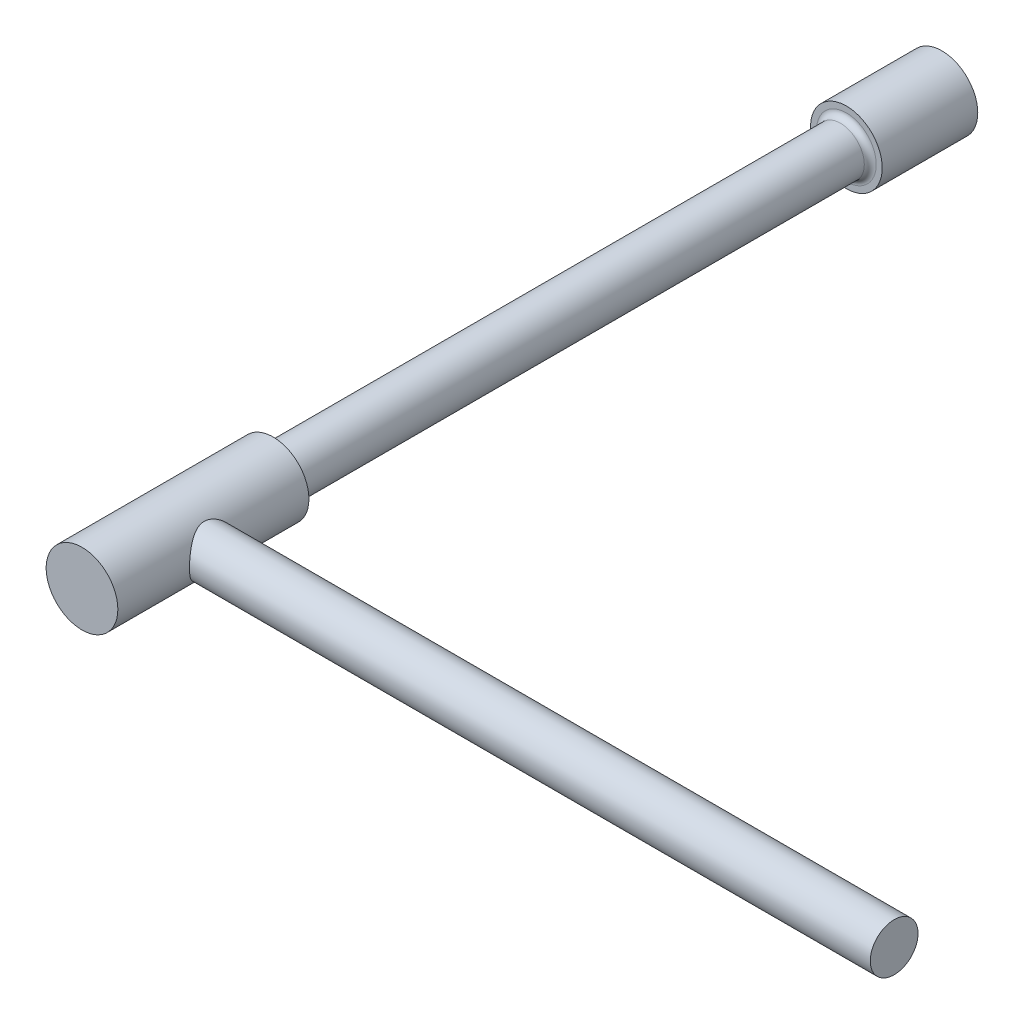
ISO-10303-21;
HEADER;
FILE_DESCRIPTION(('STEP AP214'),'2;1');
FILE_NAME('part.step','',(''),(''),'','','');
FILE_SCHEMA(('AUTOMOTIVE_DESIGN { 1 0 10303 214 1 1 1 1 }'));
ENDSEC;
DATA;
#1=APPLICATION_CONTEXT('core data for automotive mechanical design processes');
#2=APPLICATION_PROTOCOL_DEFINITION('international standard','automotive_design',2000,#1);
#3=PRODUCT_CONTEXT('',#1,'mechanical');
#4=PRODUCT('Part','Part','',(#3));
#5=PRODUCT_RELATED_PRODUCT_CATEGORY('part','',(#4));
#6=PRODUCT_DEFINITION_FORMATION('','',#4);
#7=PRODUCT_DEFINITION_CONTEXT('part definition',#1,'design');
#8=PRODUCT_DEFINITION('design','',#6,#7);
#9=PRODUCT_DEFINITION_SHAPE('','',#8);
#10=(LENGTH_UNIT() NAMED_UNIT(*) SI_UNIT(.MILLI.,.METRE.));
#11=(NAMED_UNIT(*) PLANE_ANGLE_UNIT() SI_UNIT($,.RADIAN.));
#12=(NAMED_UNIT(*) SI_UNIT($,.STERADIAN.) SOLID_ANGLE_UNIT());
#13=UNCERTAINTY_MEASURE_WITH_UNIT(LENGTH_MEASURE(1.E-05),#10,'distance_accuracy_value','');
#14=(GEOMETRIC_REPRESENTATION_CONTEXT(3) GLOBAL_UNCERTAINTY_ASSIGNED_CONTEXT((#13)) GLOBAL_UNIT_ASSIGNED_CONTEXT((#10,
#11,#12)) REPRESENTATION_CONTEXT('',''));
#15=CARTESIAN_POINT('',(0.,0.,0.));
#16=DIRECTION('',(0.,0.,1.));
#17=DIRECTION('',(1.,0.,0.));
#18=AXIS2_PLACEMENT_3D('',#15,#16,#17);
#19=CARTESIAN_POINT('',(0.,0.,457.2));
#20=DIRECTION('',(0.,0.,-1.));
#21=DIRECTION('',(-1.,0.,0.));
#22=AXIS2_PLACEMENT_3D('',#19,#20,#21);
#23=CYLINDRICAL_SURFACE('',#22,19.05);
#24=CARTESIAN_POINT('',(0.,0.,457.2));
#25=DIRECTION('',(0.,0.,1.));
#26=DIRECTION('',(1.,0.,0.));
#27=AXIS2_PLACEMENT_3D('',#24,#25,#26);
#28=CIRCLE('',#27,19.05);
#29=CARTESIAN_POINT('',(19.05,0.,457.2));
#30=VERTEX_POINT('',#29);
#31=EDGE_CURVE('E68',#30,#30,#28,.T.);
#32=ORIENTED_EDGE('',*,*,#31,.F.);
#33=EDGE_LOOP('',(#32));
#34=FACE_BOUND('',#33,.T.);
#35=CARTESIAN_POINT('',(0.,0.,355.6));
#36=DIRECTION('',(0.,0.,1.));
#37=DIRECTION('',(1.,0.,0.));
#38=AXIS2_PLACEMENT_3D('',#35,#36,#37);
#39=CIRCLE('',#38,19.05);
#40=CARTESIAN_POINT('',(19.05,0.,355.6));
#41=VERTEX_POINT('',#40);
#42=EDGE_CURVE('E71',#41,#41,#39,.T.);
#43=ORIENTED_EDGE('',*,*,#42,.T.);
#44=EDGE_LOOP('',(#43));
#45=FACE_BOUND('',#44,.T.);
#46=CARTESIAN_POINT('',(19.05,0.,419.1));
#47=CARTESIAN_POINT('',(19.0499999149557,-0.319044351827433,419.099999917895));
#48=CARTESIAN_POINT('',(19.041968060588,-0.638090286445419,419.087961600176));
#49=CARTESIAN_POINT('',(19.0100429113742,-1.27357416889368,419.039998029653));
#50=CARTESIAN_POINT('',(18.9861495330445,-1.59001210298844,419.004072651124));
#51=CARTESIAN_POINT('',(18.9230795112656,-2.21792085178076,418.90886518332));
#52=CARTESIAN_POINT('',(18.8838969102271,-2.52938968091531,418.849573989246));
#53=CARTESIAN_POINT('',(18.7911802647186,-3.14498780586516,418.708484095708));
#54=CARTESIAN_POINT('',(18.7376460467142,-3.44911701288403,418.626685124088));
#55=CARTESIAN_POINT('',(18.6177206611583,-4.04665380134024,418.442089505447));
#56=CARTESIAN_POINT('',(18.551392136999,-4.34010566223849,418.339395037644));
#57=CARTESIAN_POINT('',(18.4071052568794,-4.91621490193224,418.113945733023));
#58=CARTESIAN_POINT('',(18.3291469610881,-5.19887233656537,417.99119099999));
#59=CARTESIAN_POINT('',(18.1631367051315,-5.75207432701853,417.726853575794));
#60=CARTESIAN_POINT('',(18.0750863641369,-6.02262081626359,417.585273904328));
#61=CARTESIAN_POINT('',(17.890458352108,-6.55074759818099,417.284397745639));
#62=CARTESIAN_POINT('',(17.7938775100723,-6.80832301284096,417.12509466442));
#63=CARTESIAN_POINT('',(17.5854082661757,-7.33086574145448,416.775710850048));
#64=CARTESIAN_POINT('',(17.4729161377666,-7.59461321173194,416.584166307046));
#65=CARTESIAN_POINT('',(17.2420675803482,-8.10506530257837,416.182808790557));
#66=CARTESIAN_POINT('',(17.1237109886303,-8.35176944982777,415.972995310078));
#67=CARTESIAN_POINT('',(16.8831992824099,-8.82787123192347,415.535824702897));
#68=CARTESIAN_POINT('',(16.7610388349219,-9.057242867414,415.308442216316));
#69=CARTESIAN_POINT('',(16.5154631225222,-9.49765992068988,414.837323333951));
#70=CARTESIAN_POINT('',(16.3920481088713,-9.70870893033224,414.59359016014));
#71=CARTESIAN_POINT('',(16.1269912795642,-10.1438339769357,414.050624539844));
#72=CARTESIAN_POINT('',(15.9855513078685,-10.3646977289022,413.74870853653));
#73=CARTESIAN_POINT('',(15.7084356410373,-10.7800697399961,413.124628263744));
#74=CARTESIAN_POINT('',(15.5727612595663,-10.9745720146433,412.80245942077));
#75=CARTESIAN_POINT('',(15.3120771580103,-11.3354426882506,412.139337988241));
#76=CARTESIAN_POINT('',(15.1870504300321,-11.5018563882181,411.798416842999));
#77=CARTESIAN_POINT('',(14.9525421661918,-11.8051159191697,411.098366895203));
#78=CARTESIAN_POINT('',(14.8430611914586,-11.9419606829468,410.739237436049));
#79=CARTESIAN_POINT('',(14.6737887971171,-12.148859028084,410.110908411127));
#80=CARTESIAN_POINT('',(14.6087779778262,-12.2267886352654,409.845687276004));
#81=CARTESIAN_POINT('',(14.4914306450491,-12.3656463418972,409.308220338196));
#82=CARTESIAN_POINT('',(14.4390859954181,-12.4265853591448,409.035979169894));
#83=CARTESIAN_POINT('',(14.348894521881,-12.5306215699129,408.486077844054));
#84=CARTESIAN_POINT('',(14.3110297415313,-12.5737408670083,408.208424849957));
#85=CARTESIAN_POINT('',(14.2511622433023,-12.6415558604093,407.64915768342));
#86=CARTESIAN_POINT('',(14.2291596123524,-12.6662514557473,407.367543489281));
#87=CARTESIAN_POINT('',(14.2018752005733,-12.6968370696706,406.801303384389));
#88=CARTESIAN_POINT('',(14.1966630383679,-12.7026487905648,406.516669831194));
#89=CARTESIAN_POINT('',(14.2033816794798,-12.695135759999,405.947860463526));
#90=CARTESIAN_POINT('',(14.2153125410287,-12.6818109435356,405.663684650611));
#91=CARTESIAN_POINT('',(14.2558189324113,-12.6362591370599,405.097853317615));
#92=CARTESIAN_POINT('',(14.2844068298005,-12.6040181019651,404.816199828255));
#93=CARTESIAN_POINT('',(14.357069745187,-12.5211847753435,404.257651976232));
#94=CARTESIAN_POINT('',(14.4011450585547,-12.470592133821,403.980757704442));
#95=CARTESIAN_POINT('',(14.5008617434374,-12.3544761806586,403.445590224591));
#96=CARTESIAN_POINT('',(14.5559009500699,-12.2897177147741,403.187036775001));
#97=CARTESIAN_POINT('',(14.6769594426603,-12.1448862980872,402.676816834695));
#98=CARTESIAN_POINT('',(14.7429822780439,-12.0648083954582,402.425152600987));
#99=CARTESIAN_POINT('',(14.8842370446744,-11.8901049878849,401.929604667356));
#100=CARTESIAN_POINT('',(14.9594690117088,-11.7954794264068,401.685720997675));
#101=CARTESIAN_POINT('',(15.1173998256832,-11.592379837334,401.206300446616));
#102=CARTESIAN_POINT('',(15.2000989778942,-11.4839052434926,400.970763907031));
#103=CARTESIAN_POINT('',(15.3887310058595,-11.2302825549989,400.461367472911));
#104=CARTESIAN_POINT('',(15.4959665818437,-11.0821640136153,400.189466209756));
#105=CARTESIAN_POINT('',(15.7161179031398,-10.7676822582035,399.658923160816));
#106=CARTESIAN_POINT('',(15.829033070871,-10.6013208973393,399.400280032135));
#107=CARTESIAN_POINT('',(16.058224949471,-10.2508438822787,398.896367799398));
#108=CARTESIAN_POINT('',(16.1745055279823,-10.0667071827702,398.651115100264));
#109=CARTESIAN_POINT('',(16.4080174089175,-9.68143701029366,398.174818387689));
#110=CARTESIAN_POINT('',(16.525248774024,-9.48030240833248,397.943775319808));
#111=CARTESIAN_POINT('',(16.7837163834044,-9.01633250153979,397.448213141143));
#112=CARTESIAN_POINT('',(16.9246742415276,-8.7495482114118,397.187227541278));
#113=CARTESIAN_POINT('',(17.2012588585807,-8.19243189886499,396.688467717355));
#114=CARTESIAN_POINT('',(17.3368846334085,-7.90209555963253,396.450697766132));
#115=CARTESIAN_POINT('',(17.5992409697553,-7.29912570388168,396.000275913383));
#116=CARTESIAN_POINT('',(17.7259780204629,-6.98650879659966,395.787605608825));
#117=CARTESIAN_POINT('',(17.9673044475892,-6.34014069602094,395.389249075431));
#118=CARTESIAN_POINT('',(18.0818971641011,-6.00639535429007,395.203555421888));
#119=CARTESIAN_POINT('',(18.2747724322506,-5.38691504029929,394.894944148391));
#120=CARTESIAN_POINT('',(18.3557696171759,-5.10459086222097,394.766855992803));
#121=CARTESIAN_POINT('',(18.5062654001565,-4.5287042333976,394.530811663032));
#122=CARTESIAN_POINT('',(18.5757661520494,-4.23514390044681,394.422851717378));
#123=CARTESIAN_POINT('',(18.7017836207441,-3.6385009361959,394.228323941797));
#124=CARTESIAN_POINT('',(18.7583086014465,-3.33542450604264,394.141742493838));
#125=CARTESIAN_POINT('',(18.8571698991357,-2.72145399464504,393.990987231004));
#126=CARTESIAN_POINT('',(18.8995059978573,-2.41055979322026,393.926813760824));
#127=CARTESIAN_POINT('',(18.9691377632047,-1.78179294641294,393.821555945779));
#128=CARTESIAN_POINT('',(18.996366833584,-1.46389572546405,393.780573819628));
#129=CARTESIAN_POINT('',(19.034820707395,-0.82494114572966,393.722761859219));
#130=CARTESIAN_POINT('',(19.0460454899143,-0.503883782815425,393.705932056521));
#131=CARTESIAN_POINT('',(19.0522045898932,0.138725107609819,393.696692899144));
#132=CARTESIAN_POINT('',(19.0471395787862,0.460276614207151,393.704282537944));
#133=CARTESIAN_POINT('',(19.0208492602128,1.1012052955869,393.743759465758));
#134=CARTESIAN_POINT('',(18.9996246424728,1.42058256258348,393.775645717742));
#135=CARTESIAN_POINT('',(18.9436003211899,2.03226782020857,393.860127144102));
#136=CARTESIAN_POINT('',(18.9098612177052,2.32489890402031,393.911106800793));
#137=CARTESIAN_POINT('',(18.8295982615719,2.90417350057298,394.032972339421));
#138=CARTESIAN_POINT('',(18.7830751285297,3.19081734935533,394.103857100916));
#139=CARTESIAN_POINT('',(18.6781723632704,3.75647970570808,394.264706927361));
#140=CARTESIAN_POINT('',(18.6197919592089,4.03549771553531,394.354673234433));
#141=CARTESIAN_POINT('',(18.4922798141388,4.58448654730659,394.552736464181));
#142=CARTESIAN_POINT('',(18.4231475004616,4.85445688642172,394.660834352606));
#143=CARTESIAN_POINT('',(18.2708860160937,5.40020940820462,394.901219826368));
#144=CARTESIAN_POINT('',(18.1871630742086,5.67535503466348,395.034575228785));
#145=CARTESIAN_POINT('',(18.0105704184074,6.21304645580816,395.319358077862));
#146=CARTESIAN_POINT('',(17.9177004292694,6.47559187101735,395.47078606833));
#147=CARTESIAN_POINT('',(17.7244005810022,6.98734375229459,395.790658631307));
#148=CARTESIAN_POINT('',(17.6239673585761,7.23654419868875,395.959110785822));
#149=CARTESIAN_POINT('',(17.4172474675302,7.72083737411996,396.311964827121));
#150=CARTESIAN_POINT('',(17.3109601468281,7.95592852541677,396.49636849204));
#151=CARTESIAN_POINT('',(17.0771108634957,8.44749054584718,396.910589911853));
#152=CARTESIAN_POINT('',(16.948842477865,8.70146366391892,397.142977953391));
#153=CARTESIAN_POINT('',(16.6895134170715,9.18906491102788,397.626797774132));
#154=CARTESIAN_POINT('',(16.5584523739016,9.42269033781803,397.878232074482));
#155=CARTESIAN_POINT('',(16.2963694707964,9.8690353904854,398.399379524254));
#156=CARTESIAN_POINT('',(16.1653476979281,10.0817407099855,398.669104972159));
#157=CARTESIAN_POINT('',(15.9065761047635,10.485264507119,399.225919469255));
#158=CARTESIAN_POINT('',(15.7788259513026,10.6760852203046,399.51300674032));
#159=CARTESIAN_POINT('',(15.540546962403,11.0197028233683,400.078903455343));
#160=CARTESIAN_POINT('',(15.4294753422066,11.1743505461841,400.356360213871));
#161=CARTESIAN_POINT('',(15.2158323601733,11.4635626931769,400.924747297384));
#162=CARTESIAN_POINT('',(15.1132611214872,11.5981268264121,401.215677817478));
#163=CARTESIAN_POINT('',(14.9199086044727,11.8458215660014,401.809799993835));
#164=CARTESIAN_POINT('',(14.8291101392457,11.9589835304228,402.11297290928));
#165=CARTESIAN_POINT('',(14.662441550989,12.162757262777,402.730795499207));
#166=CARTESIAN_POINT('',(14.58656799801,12.2533742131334,403.045442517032));
#167=CARTESIAN_POINT('',(14.4650085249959,12.3964989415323,403.626976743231));
#168=CARTESIAN_POINT('',(14.4163477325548,12.4529292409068,403.892279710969));
#169=CARTESIAN_POINT('',(14.3328687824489,12.5489216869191,404.428049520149));
#170=CARTESIAN_POINT('',(14.2980478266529,12.5884872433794,404.698515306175));
#171=CARTESIAN_POINT('',(14.2435454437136,12.6501231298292,405.242718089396));
#172=CARTESIAN_POINT('',(14.2238506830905,12.6722088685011,405.516451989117));
#173=CARTESIAN_POINT('',(14.2003241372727,12.6985673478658,406.065469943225));
#174=CARTESIAN_POINT('',(14.1964925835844,12.7028398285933,406.340754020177));
#175=CARTESIAN_POINT('',(14.2048515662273,12.6934916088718,406.890928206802));
#176=CARTESIAN_POINT('',(14.2170512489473,12.6798606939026,407.165818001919));
#177=CARTESIAN_POINT('',(14.2569974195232,12.6349285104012,407.712991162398));
#178=CARTESIAN_POINT('',(14.2847437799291,12.6036273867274,407.985274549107));
#179=CARTESIAN_POINT('',(14.3547629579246,12.523820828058,408.525701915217));
#180=CARTESIAN_POINT('',(14.3970516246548,12.4752966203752,408.793841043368));
#181=CARTESIAN_POINT('',(14.4946700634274,12.3617406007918,409.324202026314));
#182=CARTESIAN_POINT('',(14.5500027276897,12.2967051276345,409.586422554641));
#183=CARTESIAN_POINT('',(14.6882370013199,12.131474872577,410.172682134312));
#184=CARTESIAN_POINT('',(14.7745561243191,12.0265291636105,410.494582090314));
#185=CARTESIAN_POINT('',(14.9616336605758,11.7929800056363,411.125337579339));
#186=CARTESIAN_POINT('',(15.0623960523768,11.6643700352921,411.434189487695));
#187=CARTESIAN_POINT('',(15.2748294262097,11.3847676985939,412.038075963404));
#188=CARTESIAN_POINT('',(15.386512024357,11.2337514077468,412.333095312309));
#189=CARTESIAN_POINT('',(15.6173044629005,10.910624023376,412.908232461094));
#190=CARTESIAN_POINT('',(15.736413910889,10.7385140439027,413.188351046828));
#191=CARTESIAN_POINT('',(15.9811861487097,10.3708171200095,413.73808421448));
#192=CARTESIAN_POINT('',(16.106928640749,10.1748607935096,414.007415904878));
#193=CARTESIAN_POINT('',(16.3599595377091,9.76282141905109,414.5294461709));
#194=CARTESIAN_POINT('',(16.4872479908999,9.54673774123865,414.782144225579));
#195=CARTESIAN_POINT('',(16.7406639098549,9.09503982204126,415.270221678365));
#196=CARTESIAN_POINT('',(16.8667910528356,8.85942032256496,415.505596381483));
#197=CARTESIAN_POINT('',(17.1152748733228,8.36931136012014,415.95802611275));
#198=CARTESIAN_POINT('',(17.2376312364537,8.1148203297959,416.175079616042));
#199=CARTESIAN_POINT('',(17.4932547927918,7.54970254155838,416.619545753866));
#200=CARTESIAN_POINT('',(17.6255602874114,7.23626632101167,416.843958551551));
#201=CARTESIAN_POINT('',(17.8784147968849,6.58682136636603,417.265247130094));
#202=CARTESIAN_POINT('',(17.9989620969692,6.25080935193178,417.462118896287));
#203=CARTESIAN_POINT('',(18.2246695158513,5.55844604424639,417.825688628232));
#204=CARTESIAN_POINT('',(18.3298484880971,5.20212043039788,417.992423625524));
#205=CARTESIAN_POINT('',(18.5216848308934,4.47127050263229,418.293433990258));
#206=CARTESIAN_POINT('',(18.6083487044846,4.09675263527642,418.427720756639));
#207=CARTESIAN_POINT('',(18.7433618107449,3.41771005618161,418.635434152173));
#208=CARTESIAN_POINT('',(18.7959457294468,3.11611666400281,418.715753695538));
#209=CARTESIAN_POINT('',(18.8869925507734,2.50581917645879,418.854265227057));
#210=CARTESIAN_POINT('',(18.9254581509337,2.19711645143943,418.912461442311));
#211=CARTESIAN_POINT('',(18.9873565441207,1.57494955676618,419.00588878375));
#212=CARTESIAN_POINT('',(19.0107983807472,1.2614883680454,419.041133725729));
#213=CARTESIAN_POINT('',(19.0421204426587,0.63201870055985,419.088189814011));
#214=CARTESIAN_POINT('',(19.0500000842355,0.31601012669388,419.100000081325));
#215=CARTESIAN_POINT('',(19.05,0.,419.1));
#216=B_SPLINE_CURVE_WITH_KNOTS('',3,(#46,#47,#48,#49,#50,#51,#52,#53,#54,#55,#56,#57,#58,#59,
#60,#61,#62,#63,#64,#65,#66,#67,#68,#69,#70,#71,#72,#73,#74,#75,#76,#77,#78,#79,#80,#81,#82,#83,
#84,#85,#86,#87,#88,#89,#90,#91,#92,#93,#94,#95,#96,#97,#98,#99,#100,#101,#102,#103,#104,#105,
#106,#107,#108,#109,#110,#111,#112,#113,#114,#115,#116,#117,#118,#119,#120,#121,#122,#123,#124,
#125,#126,#127,#128,#129,#130,#131,#132,#133,#134,#135,#136,#137,#138,#139,#140,#141,#142,#143,
#144,#145,#146,#147,#148,#149,#150,#151,#152,#153,#154,#155,#156,#157,#158,#159,#160,#161,#162,
#163,#164,#165,#166,#167,#168,#169,#170,#171,#172,#173,#174,#175,#176,#177,#178,#179,#180,#181,
#182,#183,#184,#185,#186,#187,#188,#189,#190,#191,#192,#193,#194,#195,#196,#197,#198,#199,#200,
#201,#202,#203,#204,#205,#206,#207,#208,#209,#210,#211,#212,#213,#214,#215),.UNSPECIFIED.,.T.,
.F.,(4,2,2,2,2,2,2,2,2,2,2,2,2,2,2,2,2,2,2,2,2,2,2,2,2,2,2,2,2,2,2,2,2,2,2,2,2,2,2,2,2,2,2,2,2,
2,2,2,2,2,2,2,2,2,2,2,2,2,2,2,2,2,2,2,2,2,2,2,2,2,2,2,2,2,2,2,2,2,2,2,2,2,2,2,4),(0.,
0.956810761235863,1.91362655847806,2.87081556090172,3.82801613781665,4.78064387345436,
5.73326668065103,6.68573686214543,7.63856260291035,8.67204187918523,9.7055498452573,
10.7405785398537,11.7754038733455,12.9737687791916,14.1724052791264,15.369089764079,
16.5658174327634,17.4169624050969,18.2675591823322,19.1170976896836,19.9666408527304,
20.8197019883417,21.6727660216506,22.526464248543,23.3801787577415,24.1958922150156,
25.011869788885,25.8278505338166,26.6438646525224,27.625984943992,28.6080055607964,
29.5912034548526,30.574466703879,31.7698891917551,32.96553128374,34.1602912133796,
35.3547216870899,36.3150486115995,37.2751954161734,38.2347290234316,39.1942773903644,
40.1580227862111,41.1217694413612,42.0854763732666,43.0491421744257,43.9449821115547,
44.840771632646,45.7366194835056,46.6325150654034,47.5826127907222,48.5327391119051,
49.483290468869,50.4339479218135,51.5349337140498,52.6360654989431,53.7379451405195,
54.8397121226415,55.8483172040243,56.856936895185,57.8640671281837,58.8709656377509,
59.6968309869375,60.5225292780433,61.3474988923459,62.1724805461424,62.99793308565,
63.8233788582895,64.6497271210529,65.4762587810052,66.522957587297,67.5699452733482,
68.6180590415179,69.6661174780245,70.7331964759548,71.8003088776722,72.8677094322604,
73.9351987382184,75.1562166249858,76.3774123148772,77.5970970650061,78.8163527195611,
79.7647809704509,80.713027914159,81.6607035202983,82.6084146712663),.UNSPECIFIED.);
#217=CARTESIAN_POINT('',(19.05,0.,419.1));
#218=VERTEX_POINT('',#217);
#219=EDGE_CURVE('E11',#218,#218,#216,.T.);
#220=ORIENTED_EDGE('',*,*,#219,.F.);
#221=EDGE_LOOP('',(#220));
#222=FACE_BOUND('',#221,.T.);
#223=ADVANCED_FACE('F40',(#34,#45,#222),#23,.T.);
#224=CARTESIAN_POINT('',(0.,0.,50.8));
#225=DIRECTION('',(0.,0.,-1.));
#226=DIRECTION('',(-1.,0.,0.));
#227=AXIS2_PLACEMENT_3D('',#224,#225,#226);
#228=CYLINDRICAL_SURFACE('',#227,19.05);
#229=CARTESIAN_POINT('',(0.,0.,50.8));
#230=DIRECTION('',(0.,0.,1.));
#231=DIRECTION('',(1.,0.,0.));
#232=AXIS2_PLACEMENT_3D('',#229,#230,#231);
#233=CIRCLE('',#232,19.05);
#234=CARTESIAN_POINT('',(19.05,0.,50.8));
#235=VERTEX_POINT('',#234);
#236=EDGE_CURVE('E55',#235,#235,#233,.T.);
#237=ORIENTED_EDGE('',*,*,#236,.F.);
#238=EDGE_LOOP('',(#237));
#239=FACE_BOUND('',#238,.T.);
#240=CARTESIAN_POINT('',(0.,0.,0.));
#241=DIRECTION('',(0.,0.,1.));
#242=DIRECTION('',(1.,0.,0.));
#243=AXIS2_PLACEMENT_3D('',#240,#241,#242);
#244=CIRCLE('',#243,19.05);
#245=CARTESIAN_POINT('',(19.05,0.,0.));
#246=VERTEX_POINT('',#245);
#247=EDGE_CURVE('E59',#246,#246,#244,.T.);
#248=ORIENTED_EDGE('',*,*,#247,.T.);
#249=EDGE_LOOP('',(#248));
#250=FACE_BOUND('',#249,.T.);
#251=ADVANCED_FACE('F42',(#239,#250),#228,.T.);
#252=CARTESIAN_POINT('',(0.,0.,50.8));
#253=DIRECTION('',(0.,0.,1.));
#254=DIRECTION('',(1.,0.,0.));
#255=AXIS2_PLACEMENT_3D('',#252,#253,#254);
#256=PLANE('',#255);
#257=CARTESIAN_POINT('',(0.,0.,50.8));
#258=DIRECTION('',(0.,0.,-1.));
#259=DIRECTION('',(0.,1.,0.));
#260=AXIS2_PLACEMENT_3D('',#257,#258,#259);
#261=CIRCLE('',#260,15.875);
#262=CARTESIAN_POINT('',(0.,15.875,50.8));
#263=VERTEX_POINT('',#262);
#264=EDGE_CURVE('E51',#263,#263,#261,.F.);
#265=ORIENTED_EDGE('',*,*,#264,.F.);
#266=EDGE_LOOP('',(#265));
#267=FACE_BOUND('',#266,.T.);
#268=ORIENTED_EDGE('',*,*,#236,.T.);
#269=EDGE_LOOP('',(#268));
#270=FACE_BOUND('',#269,.T.);
#271=ADVANCED_FACE('F100',(#267,#270),#256,.T.);
#272=CARTESIAN_POINT('',(0.,0.,0.));
#273=DIRECTION('',(0.,0.,1.));
#274=DIRECTION('',(1.,0.,0.));
#275=AXIS2_PLACEMENT_3D('',#272,#273,#274);
#276=PLANE('',#275);
#277=ORIENTED_EDGE('',*,*,#247,.F.);
#278=EDGE_LOOP('',(#277));
#279=FACE_BOUND('',#278,.T.);
#280=ADVANCED_FACE('F113',(#279),#276,.F.);
#281=CARTESIAN_POINT('',(0.,0.,53.975));
#282=DIRECTION('',(0.,0.,-1.));
#283=DIRECTION('',(0.,1.,0.));
#284=AXIS2_PLACEMENT_3D('',#281,#282,#283);
#285=TOROIDAL_SURFACE('',#284,15.875,3.175);
#286=CARTESIAN_POINT('',(0.,0.,53.975));
#287=DIRECTION('',(0.,0.,1.));
#288=DIRECTION('',(1.,0.,0.));
#289=AXIS2_PLACEMENT_3D('',#286,#287,#288);
#290=CIRCLE('',#289,12.7);
#291=CARTESIAN_POINT('',(12.7,0.,53.975));
#292=VERTEX_POINT('',#291);
#293=EDGE_CURVE('E64',#292,#292,#290,.T.);
#294=ORIENTED_EDGE('',*,*,#293,.F.);
#295=EDGE_LOOP('',(#294));
#296=FACE_BOUND('',#295,.T.);
#297=ORIENTED_EDGE('',*,*,#264,.T.);
#298=EDGE_LOOP('',(#297));
#299=FACE_BOUND('',#298,.T.);
#300=ADVANCED_FACE('F109',(#296,#299),#285,.F.);
#301=CARTESIAN_POINT('',(0.,0.,355.6));
#302=DIRECTION('',(0.,0.,-1.));
#303=DIRECTION('',(-1.,0.,0.));
#304=AXIS2_PLACEMENT_3D('',#301,#302,#303);
#305=CYLINDRICAL_SURFACE('',#304,12.7);
#306=CARTESIAN_POINT('',(0.,0.,355.6));
#307=DIRECTION('',(0.,0.,1.));
#308=DIRECTION('',(1.,0.,0.));
#309=AXIS2_PLACEMENT_3D('',#306,#307,#308);
#310=CIRCLE('',#309,12.7);
#311=CARTESIAN_POINT('',(12.7,0.,355.6));
#312=VERTEX_POINT('',#311);
#313=EDGE_CURVE('E63',#312,#312,#310,.T.);
#314=ORIENTED_EDGE('',*,*,#313,.F.);
#315=EDGE_LOOP('',(#314));
#316=FACE_BOUND('',#315,.T.);
#317=ORIENTED_EDGE('',*,*,#293,.T.);
#318=EDGE_LOOP('',(#317));
#319=FACE_BOUND('',#318,.T.);
#320=ADVANCED_FACE('F106',(#316,#319),#305,.T.);
#321=CARTESIAN_POINT('',(0.,0.,457.2));
#322=DIRECTION('',(0.,0.,1.));
#323=DIRECTION('',(1.,0.,0.));
#324=AXIS2_PLACEMENT_3D('',#321,#322,#323);
#325=PLANE('',#324);
#326=ORIENTED_EDGE('',*,*,#31,.T.);
#327=EDGE_LOOP('',(#326));
#328=FACE_BOUND('',#327,.T.);
#329=ADVANCED_FACE('F90',(#328),#325,.T.);
#330=CARTESIAN_POINT('',(0.,0.,355.6));
#331=DIRECTION('',(0.,0.,1.));
#332=DIRECTION('',(1.,0.,0.));
#333=AXIS2_PLACEMENT_3D('',#330,#331,#332);
#334=PLANE('',#333);
#335=ORIENTED_EDGE('',*,*,#313,.T.);
#336=EDGE_LOOP('',(#335));
#337=FACE_BOUND('',#336,.T.);
#338=ORIENTED_EDGE('',*,*,#42,.F.);
#339=EDGE_LOOP('',(#338));
#340=FACE_BOUND('',#339,.T.);
#341=ADVANCED_FACE('F84',(#337,#340),#334,.F.);
#342=CARTESIAN_POINT('',(381.,0.,406.4));
#343=DIRECTION('',(-1.,0.,0.));
#344=DIRECTION('',(0.,0.,1.));
#345=AXIS2_PLACEMENT_3D('',#342,#343,#344);
#346=CYLINDRICAL_SURFACE('',#345,12.7);
#347=CARTESIAN_POINT('',(381.,0.,406.4));
#348=DIRECTION('',(1.,0.,0.));
#349=DIRECTION('',(0.,0.,-1.));
#350=AXIS2_PLACEMENT_3D('',#347,#348,#349);
#351=CIRCLE('',#350,12.7);
#352=CARTESIAN_POINT('',(381.,0.,393.7));
#353=VERTEX_POINT('',#352);
#354=EDGE_CURVE('E74',#353,#353,#351,.T.);
#355=ORIENTED_EDGE('',*,*,#354,.F.);
#356=EDGE_LOOP('',(#355));
#357=FACE_BOUND('',#356,.T.);
#358=ORIENTED_EDGE('',*,*,#219,.T.);
#359=EDGE_LOOP('',(#358));
#360=FACE_BOUND('',#359,.T.);
#361=ADVANCED_FACE('F82',(#357,#360),#346,.T.);
#362=CARTESIAN_POINT('',(381.,0.,406.4));
#363=DIRECTION('',(1.,0.,0.));
#364=DIRECTION('',(0.,0.,-1.));
#365=AXIS2_PLACEMENT_3D('',#362,#363,#364);
#366=PLANE('',#365);
#367=ORIENTED_EDGE('',*,*,#354,.T.);
#368=EDGE_LOOP('',(#367));
#369=FACE_BOUND('',#368,.T.);
#370=ADVANCED_FACE('F80',(#369),#366,.T.);
#371=CLOSED_SHELL('',(#223,#251,#271,#280,#300,#320,#329,#341,#361,#370));
#372=MANIFOLD_SOLID_BREP('B2',#371);
#373=ADVANCED_BREP_SHAPE_REPRESENTATION('',(#18,#372),#14);
#374=SHAPE_DEFINITION_REPRESENTATION(#9,#373);
ENDSEC;
END-ISO-10303-21;
